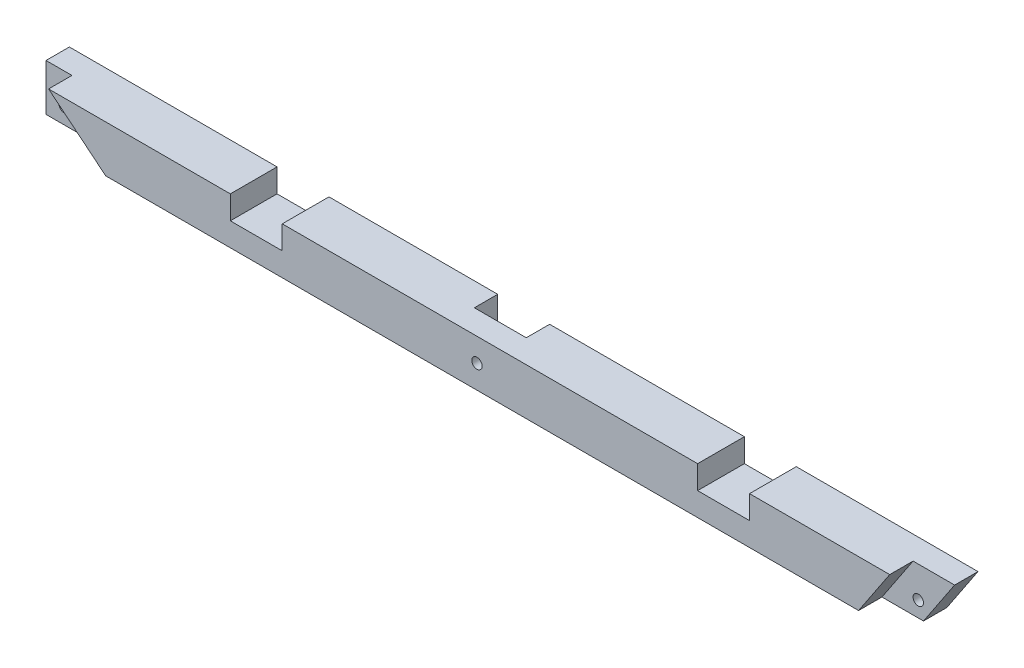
from build123d import *

# Parameters (mm, degrees)
ESQUISSE1_W             = 175
ESQUISSE1_H             = 9
EXTRUSION1_DEPTH        = 9
ENL_V_MAT_EXTRU_1_DEPTH = 4.5
ESQUISSE3_R             = 1
ENL_V_MAT_EXTRU_2_DEPTH = 4.5
ENL_V_MAT_EXTRU_3_DEPTH = 9
ENL_V_MAT_EXTRU_4_DEPTH = 4.5
ESQUISSE6_R             = 1
ENL_V_MAT_EXTRU_5_DEPTH = 4.5
ESQUISSE7_W             = 10
ESQUISSE7_H             = 9
ENL_V_MAT_EXTRU_6_DEPTH = 4.5
ESQUISSE8_R             = 1
ENL_V_MAT_EXTRU_7_DEPTH = 4.5
ESQUISSE9_W             = 10
ESQUISSE9_H             = 4.5
ENL_V_MAT_EXTRU_8_DEPTH = 9


with BuildPart() as part:
    # Esquisse1 → Extrusion1 (new body)
    with BuildSketch(Plane.XY):
        with Locations((87.5, 4.5)):
            Rectangle(ESQUISSE1_W, ESQUISSE1_H)
    extrude(amount=EXTRUSION1_DEPTH)

    # Esquisse2 → Enl_v. mat.-Extru.1 (cut)
    with BuildSketch(Plane.XY.offset(9)):
        Polygon((0, 9), (5, 9), (16, 0), (0, 0), align=None)
    extrude(amount=-ENL_V_MAT_EXTRU_1_DEPTH, mode=Mode.SUBTRACT)

    # Esquisse3 → Enl_v. mat.-Extru.2 (cut)
    with BuildSketch(Plane.XY.offset(4.5)):
        with Locations((3.5, 3)):
            Circle(ESQUISSE3_R)
    extrude(amount=-ENL_V_MAT_EXTRU_2_DEPTH, mode=Mode.SUBTRACT)

    # Esquisse4 → Enl_v. mat.-Extru.3 (cut)
    with BuildSketch(Plane.XY.offset(9)):
        Polygon((175, 9), (169, 0), (175, 0), align=None)
    extrude(amount=-ENL_V_MAT_EXTRU_3_DEPTH, mode=Mode.SUBTRACT)

    # Esquisse5 → Enl_v. mat.-Extru.4 (cut)
    with BuildSketch(Plane.XY.offset(9)):
        Polygon((175, 9), (167, 9), (161, 0), (169, 0), align=None)
    extrude(amount=-ENL_V_MAT_EXTRU_4_DEPTH, mode=Mode.SUBTRACT)

    # Esquisse6 → Enl_v. mat.-Extru.5 (cut)
    with BuildSketch(Plane.XY.offset(4.5)):
        with Locations((168, 3)):
            Circle(ESQUISSE6_R)
    extrude(amount=-ENL_V_MAT_EXTRU_5_DEPTH, mode=Mode.SUBTRACT)

    # Esquisse7 → Enl_v. mat.-Extru.6 (cut)
    with BuildSketch(Plane(origin=(0, 0, 0), x_dir=(-1, 0, 0), z_dir=(0, 0, -1))):
        with Locations((-87.5, 4.5)):
            Rectangle(ESQUISSE7_W, ESQUISSE7_H)
    extrude(amount=-ENL_V_MAT_EXTRU_6_DEPTH, mode=Mode.SUBTRACT)

    # Esquisse8 → Enl_v. mat.-Extru.7 (cut)
    with BuildSketch(Plane(origin=(0, 0, 4.5), x_dir=(-1, 0, 0), z_dir=(0, 0, -1))):
        with Locations((-87.5, 4.5)):
            Circle(ESQUISSE8_R)
    extrude(amount=-ENL_V_MAT_EXTRU_7_DEPTH, mode=Mode.SUBTRACT)

    # Esquisse9 → Enl_v. mat.-Extru.8 (cut)
    with BuildSketch(Plane(origin=(0, 0, 0), x_dir=(-1, 0, 0), z_dir=(0, 0, -1))):
        with Locations((-45, 6.75)):
            Rectangle(ESQUISSE9_W, ESQUISSE9_H)
        with Locations((-135, 6.75)):
            Rectangle(ESQUISSE9_W, ESQUISSE9_H)
    extrude(amount=-ENL_V_MAT_EXTRU_8_DEPTH, mode=Mode.SUBTRACT)


solid = part.part
